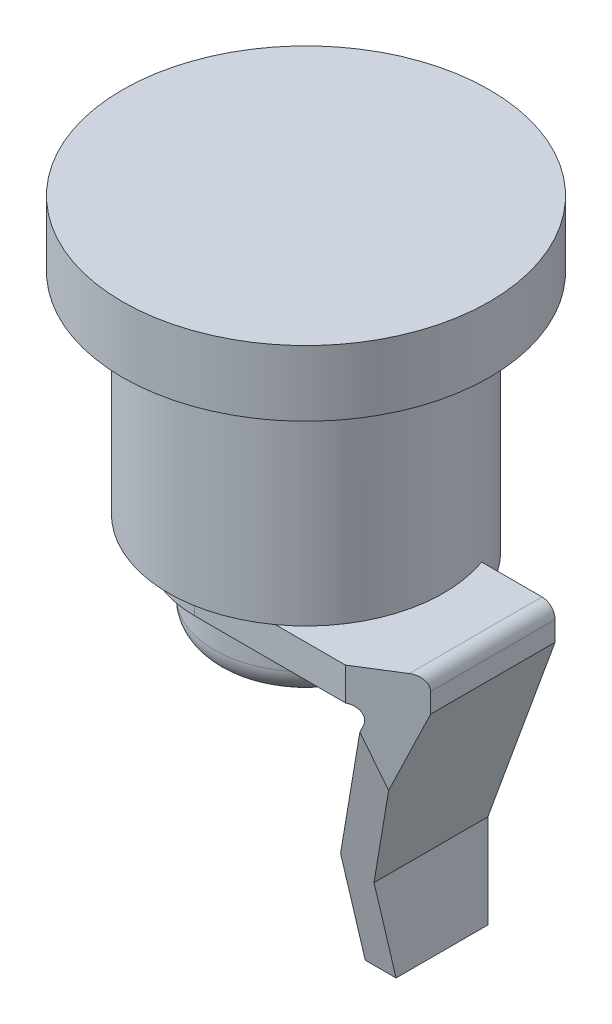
ISO-10303-21;
HEADER;
FILE_DESCRIPTION(('STEP AP214'),'2;1');
FILE_NAME('part.step','',(''),(''),'','','');
FILE_SCHEMA(('AUTOMOTIVE_DESIGN { 1 0 10303 214 1 1 1 1 }'));
ENDSEC;
DATA;
#1=APPLICATION_CONTEXT('core data for automotive mechanical design processes');
#2=APPLICATION_PROTOCOL_DEFINITION('international standard','automotive_design',2000,#1);
#3=PRODUCT_CONTEXT('',#1,'mechanical');
#4=PRODUCT('Part','Part','',(#3));
#5=PRODUCT_RELATED_PRODUCT_CATEGORY('part','',(#4));
#6=PRODUCT_DEFINITION_FORMATION('','',#4);
#7=PRODUCT_DEFINITION_CONTEXT('part definition',#1,'design');
#8=PRODUCT_DEFINITION('design','',#6,#7);
#9=PRODUCT_DEFINITION_SHAPE('','',#8);
#10=(LENGTH_UNIT() NAMED_UNIT(*) SI_UNIT(.MILLI.,.METRE.));
#11=(NAMED_UNIT(*) PLANE_ANGLE_UNIT() SI_UNIT($,.RADIAN.));
#12=(NAMED_UNIT(*) SI_UNIT($,.STERADIAN.) SOLID_ANGLE_UNIT());
#13=UNCERTAINTY_MEASURE_WITH_UNIT(LENGTH_MEASURE(1.E-05),#10,'distance_accuracy_value','');
#14=(GEOMETRIC_REPRESENTATION_CONTEXT(3) GLOBAL_UNCERTAINTY_ASSIGNED_CONTEXT((#13)) GLOBAL_UNIT_ASSIGNED_CONTEXT((#10,
#11,#12)) REPRESENTATION_CONTEXT('',''));
#15=CARTESIAN_POINT('',(0.,0.,0.));
#16=DIRECTION('',(0.,0.,1.));
#17=DIRECTION('',(1.,0.,0.));
#18=AXIS2_PLACEMENT_3D('',#15,#16,#17);
#19=CARTESIAN_POINT('',(8.02046629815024,-31.7403389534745,-31.018779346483));
#20=DIRECTION('',(-0.93969262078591,0.342020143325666,0.));
#21=DIRECTION('',(-0.342020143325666,-0.93969262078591,0.));
#22=AXIS2_PLACEMENT_3D('',#19,#20,#21);
#23=PLANE('',#22);
#24=DIRECTION('',(0.342020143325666,0.93969262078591,0.));
#25=VECTOR('',#24,1.);
#26=CARTESIAN_POINT('',(8.02046629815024,-31.7403389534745,-3.5));
#27=LINE('',#26,#25);
#28=CARTESIAN_POINT('',(8.02046629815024,-31.7403389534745,-3.5));
#29=VERTEX_POINT('',#28);
#30=CARTESIAN_POINT('',(12.351100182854,-19.8420201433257,-3.5));
#31=VERTEX_POINT('',#30);
#32=EDGE_CURVE('E310',#29,#31,#27,.T.);
#33=ORIENTED_EDGE('',*,*,#32,.F.);
#34=DIRECTION('',(0.,0.,1.));
#35=VECTOR('',#34,1.);
#36=CARTESIAN_POINT('',(8.02046629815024,-31.7403389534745,-31.018779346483));
#37=LINE('',#36,#35);
#38=CARTESIAN_POINT('',(8.02046629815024,-31.7403389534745,5.38320911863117));
#39=VERTEX_POINT('',#38);
#40=EDGE_CURVE('E177',#29,#39,#37,.T.);
#41=ORIENTED_EDGE('',*,*,#40,.T.);
#42=DIRECTION('',(0.333947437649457,0.917513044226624,0.215983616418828));
#43=VECTOR('',#42,1.);
#44=CARTESIAN_POINT('',(5.39489369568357,-38.9540403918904,3.6850955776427));
#45=LINE('',#44,#43);
#46=CARTESIAN_POINT('',(12.1812374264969,-20.3087142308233,8.07422660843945));
#47=VERTEX_POINT('',#46);
#48=EDGE_CURVE('E267',#39,#47,#45,.T.);
#49=ORIENTED_EDGE('',*,*,#48,.T.);
#50=DIRECTION('',(-0.334463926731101,-0.918932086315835,0.209039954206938));
#51=VECTOR('',#50,1.);
#52=CARTESIAN_POINT('',(10.9355217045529,-23.7312900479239,8.85279893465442));
#53=LINE('',#52,#51);
#54=CARTESIAN_POINT('',(12.351100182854,-19.8420201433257,7.96806238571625));
#55=VERTEX_POINT('',#54);
#56=EDGE_CURVE('E50',#55,#47,#53,.T.);
#57=ORIENTED_EDGE('',*,*,#56,.F.);
#58=DIRECTION('',(0.,0.,1.));
#59=VECTOR('',#58,1.);
#60=CARTESIAN_POINT('',(12.351100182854,-19.8420201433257,-8.5));
#61=LINE('',#60,#59);
#62=EDGE_CURVE('E230',#55,#31,#61,.F.);
#63=ORIENTED_EDGE('',*,*,#62,.T.);
#64=EDGE_LOOP('',(#33,#41,#49,#57,#63));
#65=FACE_BOUND('',#64,.T.);
#66=ADVANCED_FACE('F35',(#65),#23,.T.);
#67=CARTESIAN_POINT('',(0.,-18.5,0.));
#68=DIRECTION('',(0.,-1.,0.));
#69=DIRECTION('',(0.,0.,-1.));
#70=AXIS2_PLACEMENT_3D('',#67,#68,#69);
#71=PLANE('',#70);
#72=CARTESIAN_POINT('',(0.,-18.5,0.));
#73=DIRECTION('',(0.,-1.,0.));
#74=DIRECTION('',(0.,0.,-1.));
#75=AXIS2_PLACEMENT_3D('',#72,#73,#74);
#76=CIRCLE('',#75,7.);
#77=CARTESIAN_POINT('',(0.,-18.5,-7.));
#78=VERTEX_POINT('',#77);
#79=EDGE_CURVE('E203',#78,#78,#76,.T.);
#80=ORIENTED_EDGE('',*,*,#79,.F.);
#81=EDGE_LOOP('',(#80));
#82=FACE_BOUND('',#81,.T.);
#83=DIRECTION('',(-1.,0.,0.));
#84=VECTOR('',#83,1.);
#85=CARTESIAN_POINT('',(0.,-18.5,-3.5));
#86=LINE('',#85,#84);
#87=CARTESIAN_POINT('',(11.4114075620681,-18.5,-3.5));
#88=VERTEX_POINT('',#87);
#89=CARTESIAN_POINT('',(9.89949493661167,-18.5,-3.5));
#90=VERTEX_POINT('',#89);
#91=EDGE_CURVE('E306',#88,#90,#86,.T.);
#92=ORIENTED_EDGE('',*,*,#91,.F.);
#93=DIRECTION('',(0.,0.,1.));
#94=VECTOR('',#93,1.);
#95=CARTESIAN_POINT('',(11.4114075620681,-18.5,8.5));
#96=LINE('',#95,#94);
#97=CARTESIAN_POINT('',(11.4114075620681,-18.5,8.5));
#98=VERTEX_POINT('',#97);
#99=EDGE_CURVE('E58',#88,#98,#96,.T.);
#100=ORIENTED_EDGE('',*,*,#99,.T.);
#101=DIRECTION('',(1.,0.,0.));
#102=VECTOR('',#101,1.);
#103=CARTESIAN_POINT('',(0.,-18.5,8.5));
#104=LINE('',#103,#102);
#105=CARTESIAN_POINT('',(0.,-18.5,8.5));
#106=VERTEX_POINT('',#105);
#107=EDGE_CURVE('E192',#106,#98,#104,.T.);
#108=ORIENTED_EDGE('',*,*,#107,.F.);
#109=CARTESIAN_POINT('',(0.,-18.5,0.));
#110=DIRECTION('',(0.,-1.,0.));
#111=DIRECTION('',(0.,0.,-1.));
#112=AXIS2_PLACEMENT_3D('',#109,#110,#111);
#113=CIRCLE('',#112,8.5);
#114=CARTESIAN_POINT('',(0.,-18.5,-8.5));
#115=VERTEX_POINT('',#114);
#116=EDGE_CURVE('E200',#106,#115,#113,.T.);
#117=ORIENTED_EDGE('',*,*,#116,.T.);
#118=DIRECTION('',(1.,0.,0.));
#119=VECTOR('',#118,1.);
#120=CARTESIAN_POINT('',(0.,-18.5,-8.5));
#121=LINE('',#120,#119);
#122=CARTESIAN_POINT('',(6.16441400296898,-18.5,-8.5));
#123=VERTEX_POINT('',#122);
#124=EDGE_CURVE('E194',#115,#123,#121,.T.);
#125=ORIENTED_EDGE('',*,*,#124,.T.);
#126=CARTESIAN_POINT('',(0.,-18.5,0.));
#127=DIRECTION('',(0.,-1.,0.));
#128=DIRECTION('',(0.,0.,-1.));
#129=AXIS2_PLACEMENT_3D('',#126,#127,#128);
#130=CIRCLE('',#129,10.5);
#131=EDGE_CURVE('E304',#90,#123,#130,.F.);
#132=ORIENTED_EDGE('',*,*,#131,.F.);
#133=EDGE_LOOP('',(#92,#100,#108,#117,#125,#132));
#134=FACE_BOUND('',#133,.T.);
#135=ADVANCED_FACE('F314',(#82,#134),#71,.T.);
#136=CARTESIAN_POINT('',(-13.800441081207,-2.86718192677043,12.179983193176));
#137=DIRECTION('',(0.,-0.229138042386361,0.973393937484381));
#138=DIRECTION('',(0.,-0.973393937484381,-0.229138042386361));
#139=AXIS2_PLACEMENT_3D('',#136,#137,#138);
#140=PLANE('',#139);
#141=DIRECTION('',(0.344216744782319,-0.913910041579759,-0.215135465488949));
#142=VECTOR('',#141,1.);
#143=CARTESIAN_POINT('',(3.31193737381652,3.2396531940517,13.6175391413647));
#144=LINE('',#143,#142);
#145=CARTESIAN_POINT('',(11.5,-18.5,8.5));
#146=VERTEX_POINT('',#145);
#147=CARTESIAN_POINT('',(11.501532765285,-18.5040695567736,8.4990420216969));
#148=VERTEX_POINT('',#147);
#149=EDGE_CURVE('E43',#146,#148,#144,.T.);
#150=ORIENTED_EDGE('',*,*,#149,.F.);
#151=DIRECTION('',(1.,0.,0.));
#152=VECTOR('',#151,1.);
#153=CARTESIAN_POINT('',(-13.800441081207,-18.5,8.5));
#154=LINE('',#153,#152);
#155=EDGE_CURVE('E167',#98,#146,#154,.T.);
#156=ORIENTED_EDGE('',*,*,#155,.F.);
#157=CARTESIAN_POINT('',(11.4114075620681,-19.5,8.26459886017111));
#158=DIRECTION('',(0.,-0.229138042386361,0.973393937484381));
#159=DIRECTION('',(0.,-0.973393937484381,-0.229138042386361));
#160=AXIS2_PLACEMENT_3D('',#157,#158,#159);
#161=ELLIPSE('',#160,1.02733329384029,1.);
#162=EDGE_CURVE('E239',#98,#148,#161,.F.);
#163=ORIENTED_EDGE('',*,*,#162,.T.);
#164=EDGE_LOOP('',(#150,#156,#163));
#165=FACE_BOUND('',#164,.T.);
#166=ADVANCED_FACE('F259',(#165),#140,.T.);
#167=CARTESIAN_POINT('',(0.,-16.,8.5));
#168=DIRECTION('',(0.,0.,-1.));
#169=DIRECTION('',(-1.,0.,0.));
#170=AXIS2_PLACEMENT_3D('',#167,#168,#169);
#171=PLANE('',#170);
#172=ORIENTED_EDGE('',*,*,#155,.T.);
#173=DIRECTION('',(0.,1.,0.));
#174=VECTOR('',#173,1.);
#175=CARTESIAN_POINT('',(11.5,-36.,8.5));
#176=LINE('',#175,#174);
#177=CARTESIAN_POINT('',(11.5,-16.,8.5));
#178=VERTEX_POINT('',#177);
#179=EDGE_CURVE('E248',#146,#178,#176,.T.);
#180=ORIENTED_EDGE('',*,*,#179,.T.);
#181=DIRECTION('',(1.,0.,0.));
#182=VECTOR('',#181,1.);
#183=CARTESIAN_POINT('',(0.,-16.,8.5));
#184=LINE('',#183,#182);
#185=CARTESIAN_POINT('',(6.16441400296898,-16.,8.5));
#186=VERTEX_POINT('',#185);
#187=EDGE_CURVE('E186',#186,#178,#184,.T.);
#188=ORIENTED_EDGE('',*,*,#187,.F.);
#189=CARTESIAN_POINT('',(0.,-16.,8.5));
#190=VERTEX_POINT('',#189);
#191=EDGE_CURVE('E182',#190,#186,#184,.T.);
#192=ORIENTED_EDGE('',*,*,#191,.F.);
#193=DIRECTION('',(0.,-1.,0.));
#194=VECTOR('',#193,1.);
#195=CARTESIAN_POINT('',(0.,-16.,8.5));
#196=LINE('',#195,#194);
#197=EDGE_CURVE('E189',#190,#106,#196,.T.);
#198=ORIENTED_EDGE('',*,*,#197,.T.);
#199=ORIENTED_EDGE('',*,*,#107,.T.);
#200=EDGE_LOOP('',(#172,#180,#188,#192,#198,#199));
#201=FACE_BOUND('',#200,.T.);
#202=ADVANCED_FACE('F336',(#201),#171,.F.);
#203=CARTESIAN_POINT('',(8.02046629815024,-31.7403389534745,-31.018779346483));
#204=DIRECTION('',(-1.,0.,0.));
#205=DIRECTION('',(0.,-1.,0.));
#206=AXIS2_PLACEMENT_3D('',#203,#204,#205);
#207=PLANE('',#206);
#208=DIRECTION('',(0.,1.,0.));
#209=VECTOR('',#208,1.);
#210=CARTESIAN_POINT('',(8.02046629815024,-31.7403389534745,-3.5));
#211=LINE('',#210,#209);
#212=CARTESIAN_POINT('',(8.02046629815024,-39.7403389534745,-3.5));
#213=VERTEX_POINT('',#212);
#214=EDGE_CURVE('E284',#213,#29,#211,.T.);
#215=ORIENTED_EDGE('',*,*,#214,.F.);
#216=DIRECTION('',(0.,0.,1.));
#217=VECTOR('',#216,1.);
#218=CARTESIAN_POINT('',(8.02046629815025,-39.7403389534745,-31.018779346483));
#219=LINE('',#218,#217);
#220=CARTESIAN_POINT('',(8.02046629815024,-39.7403389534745,3.5));
#221=VERTEX_POINT('',#220);
#222=EDGE_CURVE('E166',#213,#221,#219,.T.);
#223=ORIENTED_EDGE('',*,*,#222,.T.);
#224=DIRECTION('',(0.,-0.973393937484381,-0.229138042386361));
#225=VECTOR('',#224,1.);
#226=CARTESIAN_POINT('',(8.02046629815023,-2.86718192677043,12.179983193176));
#227=LINE('',#226,#225);
#228=EDGE_CURVE('E263',#39,#221,#227,.T.);
#229=ORIENTED_EDGE('',*,*,#228,.F.);
#230=ORIENTED_EDGE('',*,*,#40,.F.);
#231=EDGE_LOOP('',(#215,#223,#229,#230));
#232=FACE_BOUND('',#231,.T.);
#233=ADVANCED_FACE('F282',(#232),#207,.T.);
#234=CARTESIAN_POINT('',(8.02046629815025,-39.7403389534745,-31.018779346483));
#235=DIRECTION('',(0.,-1.,0.));
#236=DIRECTION('',(0.,0.,-1.));
#237=AXIS2_PLACEMENT_3D('',#234,#235,#236);
#238=PLANE('',#237);
#239=DIRECTION('',(0.,0.,1.));
#240=VECTOR('',#239,1.);
#241=CARTESIAN_POINT('',(10.369697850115,-39.7403389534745,-31.018779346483));
#242=LINE('',#241,#240);
#243=CARTESIAN_POINT('',(10.369697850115,-39.7403389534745,-3.5));
#244=VERTEX_POINT('',#243);
#245=CARTESIAN_POINT('',(10.369697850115,-39.7403389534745,3.5));
#246=VERTEX_POINT('',#245);
#247=EDGE_CURVE('E164',#244,#246,#242,.T.);
#248=ORIENTED_EDGE('',*,*,#247,.T.);
#249=DIRECTION('',(1.,0.,0.));
#250=VECTOR('',#249,1.);
#251=CARTESIAN_POINT('',(-13.800441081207,-39.7403389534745,3.5));
#252=LINE('',#251,#250);
#253=EDGE_CURVE('E261',#221,#246,#252,.T.);
#254=ORIENTED_EDGE('',*,*,#253,.F.);
#255=ORIENTED_EDGE('',*,*,#222,.F.);
#256=DIRECTION('',(1.,0.,0.));
#257=VECTOR('',#256,1.);
#258=CARTESIAN_POINT('',(-13.800441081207,-39.7403389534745,-3.5));
#259=LINE('',#258,#257);
#260=EDGE_CURVE('E151',#213,#244,#259,.T.);
#261=ORIENTED_EDGE('',*,*,#260,.T.);
#262=EDGE_LOOP('',(#248,#254,#255,#261));
#263=FACE_BOUND('',#262,.T.);
#264=ADVANCED_FACE('F162',(#263),#238,.T.);
#265=CARTESIAN_POINT('',(10.369697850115,-39.7403389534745,-31.018779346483));
#266=DIRECTION('',(1.,0.,0.));
#267=DIRECTION('',(0.,0.,-1.));
#268=AXIS2_PLACEMENT_3D('',#265,#266,#267);
#269=PLANE('',#268);
#270=ORIENTED_EDGE('',*,*,#247,.F.);
#271=DIRECTION('',(0.,-1.,0.));
#272=VECTOR('',#271,1.);
#273=CARTESIAN_POINT('',(10.369697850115,-39.7403389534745,-3.5));
#274=LINE('',#273,#272);
#275=CARTESIAN_POINT('',(10.369697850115,-32.5953893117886,-3.5));
#276=VERTEX_POINT('',#275);
#277=EDGE_CURVE('E147',#276,#244,#274,.T.);
#278=ORIENTED_EDGE('',*,*,#277,.F.);
#279=DIRECTION('',(0.,0.,1.));
#280=VECTOR('',#279,1.);
#281=CARTESIAN_POINT('',(10.369697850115,-32.5953893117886,-31.018779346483));
#282=LINE('',#281,#280);
#283=CARTESIAN_POINT('',(10.369697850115,-32.5953893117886,5.1819292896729));
#284=VERTEX_POINT('',#283);
#285=EDGE_CURVE('E173',#276,#284,#282,.T.);
#286=ORIENTED_EDGE('',*,*,#285,.T.);
#287=DIRECTION('',(0.,-0.973393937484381,-0.229138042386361));
#288=VECTOR('',#287,1.);
#289=CARTESIAN_POINT('',(10.369697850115,-47.4394620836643,1.68761763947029));
#290=LINE('',#289,#288);
#291=EDGE_CURVE('E172',#284,#246,#290,.T.);
#292=ORIENTED_EDGE('',*,*,#291,.T.);
#293=EDGE_LOOP('',(#270,#278,#286,#292));
#294=FACE_BOUND('',#293,.T.);
#295=ADVANCED_FACE('F170',(#294),#269,.T.);
#296=CARTESIAN_POINT('',(15.5,-18.5,-31.018779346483));
#297=DIRECTION('',(0.93969262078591,-0.342020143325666,0.));
#298=DIRECTION('',(0.342020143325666,0.93969262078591,0.));
#299=AXIS2_PLACEMENT_3D('',#296,#297,#298);
#300=PLANE('',#299);
#301=DIRECTION('',(0.334463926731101,0.918932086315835,-0.209039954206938));
#302=VECTOR('',#301,1.);
#303=CARTESIAN_POINT('',(18.0882169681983,-11.3889323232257,4.38236439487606));
#304=LINE('',#303,#302);
#305=CARTESIAN_POINT('',(13.5342192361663,-23.9009382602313,7.22861297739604));
#306=VERTEX_POINT('',#305);
#307=CARTESIAN_POINT('',(15.5,-18.5,6.));
#308=VERTEX_POINT('',#307);
#309=EDGE_CURVE('E276',#306,#308,#304,.T.);
#310=ORIENTED_EDGE('',*,*,#309,.F.);
#311=DIRECTION('',(-0.333947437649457,-0.917513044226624,-0.215983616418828));
#312=VECTOR('',#311,1.);
#313=CARTESIAN_POINT('',(12.6496220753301,-26.3313489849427,6.65649152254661));
#314=LINE('',#313,#312);
#315=EDGE_CURVE('E270',#306,#284,#314,.T.);
#316=ORIENTED_EDGE('',*,*,#315,.T.);
#317=ORIENTED_EDGE('',*,*,#285,.F.);
#318=DIRECTION('',(-0.342020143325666,-0.93969262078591,0.));
#319=VECTOR('',#318,1.);
#320=CARTESIAN_POINT('',(15.5,-18.5,-3.5));
#321=LINE('',#320,#319);
#322=CARTESIAN_POINT('',(15.5,-18.5,-3.5));
#323=VERTEX_POINT('',#322);
#324=EDGE_CURVE('E154',#323,#276,#321,.T.);
#325=ORIENTED_EDGE('',*,*,#324,.F.);
#326=DIRECTION('',(0.,0.,-1.));
#327=VECTOR('',#326,1.);
#328=CARTESIAN_POINT('',(15.5,-18.5,0.));
#329=LINE('',#328,#327);
#330=EDGE_CURVE('E175',#308,#323,#329,.T.);
#331=ORIENTED_EDGE('',*,*,#330,.F.);
#332=EDGE_LOOP('',(#310,#316,#317,#325,#331));
#333=FACE_BOUND('',#332,.T.);
#334=ADVANCED_FACE('F274',(#333),#300,.T.);
#335=CARTESIAN_POINT('',(11.4114075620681,-19.5,0.));
#336=DIRECTION('',(0.,0.,-1.));
#337=DIRECTION('',(-1.,0.,0.));
#338=AXIS2_PLACEMENT_3D('',#335,#336,#337);
#339=CYLINDRICAL_SURFACE('',#338,1.);
#340=ORIENTED_EDGE('',*,*,#62,.F.);
#341=CARTESIAN_POINT('',(11.4114075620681,-19.5,8.55537027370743));
#342=DIRECTION('',(-0.52999894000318,0.,-0.847998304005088));
#343=DIRECTION('',(0.847998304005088,0.,-0.52999894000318));
#344=AXIS2_PLACEMENT_3D('',#341,#342,#343);
#345=ELLIPSE('',#344,1.17924764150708,1.);
#346=EDGE_CURVE('E246',#55,#148,#345,.F.);
#347=ORIENTED_EDGE('',*,*,#346,.T.);
#348=ORIENTED_EDGE('',*,*,#162,.F.);
#349=ORIENTED_EDGE('',*,*,#99,.F.);
#350=CARTESIAN_POINT('',(11.4114075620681,-19.5,-3.5));
#351=DIRECTION('',(0.,0.,1.));
#352=DIRECTION('',(1.,0.,0.));
#353=AXIS2_PLACEMENT_3D('',#350,#351,#352);
#354=CIRCLE('',#353,1.);
#355=EDGE_CURVE('E308',#88,#31,#354,.F.);
#356=ORIENTED_EDGE('',*,*,#355,.T.);
#357=EDGE_LOOP('',(#340,#347,#348,#349,#356));
#358=FACE_BOUND('',#357,.T.);
#359=ADVANCED_FACE('F255',(#358),#339,.F.);
#360=CARTESIAN_POINT('',(0.,-18.5,0.));
#361=DIRECTION('',(0.,1.,0.));
#362=DIRECTION('',(0.,0.,1.));
#363=AXIS2_PLACEMENT_3D('',#360,#361,#362);
#364=CYLINDRICAL_SURFACE('',#363,8.5);
#365=DIRECTION('',(0.,-1.,0.));
#366=VECTOR('',#365,1.);
#367=CARTESIAN_POINT('',(0.,-16.,-8.5));
#368=LINE('',#367,#366);
#369=CARTESIAN_POINT('',(0.,-16.,-8.5));
#370=VERTEX_POINT('',#369);
#371=EDGE_CURVE('E197',#370,#115,#368,.T.);
#372=ORIENTED_EDGE('',*,*,#371,.T.);
#373=ORIENTED_EDGE('',*,*,#116,.F.);
#374=ORIENTED_EDGE('',*,*,#197,.F.);
#375=CARTESIAN_POINT('',(0.,-16.,0.));
#376=DIRECTION('',(0.,-1.,0.));
#377=DIRECTION('',(0.,0.,-1.));
#378=AXIS2_PLACEMENT_3D('',#375,#376,#377);
#379=CIRCLE('',#378,8.5);
#380=EDGE_CURVE('E207',#190,#370,#379,.T.);
#381=ORIENTED_EDGE('',*,*,#380,.T.);
#382=EDGE_LOOP('',(#372,#373,#374,#381));
#383=FACE_BOUND('',#382,.T.);
#384=ADVANCED_FACE('F351',(#383),#364,.T.);
#385=CARTESIAN_POINT('',(0.,5.,0.));
#386=DIRECTION('',(0.,-1.,0.));
#387=DIRECTION('',(0.,0.,-1.));
#388=AXIS2_PLACEMENT_3D('',#385,#386,#387);
#389=CYLINDRICAL_SURFACE('',#388,14.);
#390=CARTESIAN_POINT('',(0.,5.,0.));
#391=DIRECTION('',(0.,1.,0.));
#392=DIRECTION('',(0.,0.,1.));
#393=AXIS2_PLACEMENT_3D('',#390,#391,#392);
#394=CIRCLE('',#393,14.);
#395=CARTESIAN_POINT('',(0.,5.,14.));
#396=VERTEX_POINT('',#395);
#397=EDGE_CURVE('E219',#396,#396,#394,.T.);
#398=ORIENTED_EDGE('',*,*,#397,.F.);
#399=EDGE_LOOP('',(#398));
#400=FACE_BOUND('',#399,.T.);
#401=CARTESIAN_POINT('',(0.,0.,0.));
#402=DIRECTION('',(0.,1.,0.));
#403=DIRECTION('',(0.,0.,1.));
#404=AXIS2_PLACEMENT_3D('',#401,#402,#403);
#405=CIRCLE('',#404,14.);
#406=CARTESIAN_POINT('',(0.,0.,14.));
#407=VERTEX_POINT('',#406);
#408=EDGE_CURVE('E216',#407,#407,#405,.T.);
#409=ORIENTED_EDGE('',*,*,#408,.T.);
#410=EDGE_LOOP('',(#409));
#411=FACE_BOUND('',#410,.T.);
#412=ADVANCED_FACE('F354',(#400,#411),#389,.T.);
#413=CARTESIAN_POINT('',(0.,5.,0.));
#414=DIRECTION('',(0.,1.,0.));
#415=DIRECTION('',(0.,0.,1.));
#416=AXIS2_PLACEMENT_3D('',#413,#414,#415);
#417=PLANE('',#416);
#418=ORIENTED_EDGE('',*,*,#397,.T.);
#419=EDGE_LOOP('',(#418));
#420=FACE_BOUND('',#419,.T.);
#421=ADVANCED_FACE('F364',(#420),#417,.T.);
#422=CARTESIAN_POINT('',(0.,0.,0.));
#423=DIRECTION('',(0.,1.,0.));
#424=DIRECTION('',(0.,0.,1.));
#425=AXIS2_PLACEMENT_3D('',#422,#423,#424);
#426=PLANE('',#425);
#427=CARTESIAN_POINT('',(0.,0.,0.));
#428=DIRECTION('',(0.,-1.,0.));
#429=DIRECTION('',(0.,0.,-1.));
#430=AXIS2_PLACEMENT_3D('',#427,#428,#429);
#431=CIRCLE('',#430,10.5);
#432=CARTESIAN_POINT('',(0.,0.,-10.5));
#433=VERTEX_POINT('',#432);
#434=EDGE_CURVE('E213',#433,#433,#431,.T.);
#435=ORIENTED_EDGE('',*,*,#434,.F.);
#436=EDGE_LOOP('',(#435));
#437=FACE_BOUND('',#436,.T.);
#438=ORIENTED_EDGE('',*,*,#408,.F.);
#439=EDGE_LOOP('',(#438));
#440=FACE_BOUND('',#439,.T.);
#441=ADVANCED_FACE('F362',(#437,#440),#426,.F.);
#442=CARTESIAN_POINT('',(0.,-16.,0.));
#443=DIRECTION('',(0.,1.,0.));
#444=DIRECTION('',(0.,0.,1.));
#445=AXIS2_PLACEMENT_3D('',#442,#443,#444);
#446=CYLINDRICAL_SURFACE('',#445,10.5);
#447=CARTESIAN_POINT('',(0.,-16.,0.));
#448=DIRECTION('',(0.,-1.,0.));
#449=DIRECTION('',(0.,0.,-1.));
#450=AXIS2_PLACEMENT_3D('',#447,#448,#449);
#451=CIRCLE('',#450,10.5);
#452=CARTESIAN_POINT('',(9.89949493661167,-16.,-3.5));
#453=VERTEX_POINT('',#452);
#454=EDGE_CURVE('E214',#453,#186,#451,.T.);
#455=ORIENTED_EDGE('',*,*,#454,.F.);
#456=DIRECTION('',(0.,1.,0.));
#457=VECTOR('',#456,1.);
#458=CARTESIAN_POINT('',(9.89949493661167,-36.,-3.5));
#459=LINE('',#458,#457);
#460=EDGE_CURVE('E298',#90,#453,#459,.T.);
#461=ORIENTED_EDGE('',*,*,#460,.F.);
#462=ORIENTED_EDGE('',*,*,#131,.T.);
#463=DIRECTION('',(0.,1.,0.));
#464=VECTOR('',#463,1.);
#465=CARTESIAN_POINT('',(6.16441400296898,-36.,-8.5));
#466=LINE('',#465,#464);
#467=CARTESIAN_POINT('',(6.16441400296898,-16.,-8.5));
#468=VERTEX_POINT('',#467);
#469=EDGE_CURVE('E287',#123,#468,#466,.T.);
#470=ORIENTED_EDGE('',*,*,#469,.T.);
#471=EDGE_CURVE('E210',#186,#468,#451,.T.);
#472=ORIENTED_EDGE('',*,*,#471,.F.);
#473=EDGE_LOOP('',(#455,#461,#462,#470,#472));
#474=FACE_BOUND('',#473,.T.);
#475=ORIENTED_EDGE('',*,*,#434,.T.);
#476=EDGE_LOOP('',(#475));
#477=FACE_BOUND('',#476,.T.);
#478=ADVANCED_FACE('F358',(#474,#477),#446,.T.);
#479=CARTESIAN_POINT('',(0.,-16.,0.));
#480=DIRECTION('',(0.,-1.,0.));
#481=DIRECTION('',(0.,0.,-1.));
#482=AXIS2_PLACEMENT_3D('',#479,#480,#481);
#483=PLANE('',#482);
#484=DIRECTION('',(1.,0.,0.));
#485=VECTOR('',#484,1.);
#486=CARTESIAN_POINT('',(0.,-16.,-8.5));
#487=LINE('',#486,#485);
#488=EDGE_CURVE('E185',#370,#468,#487,.T.);
#489=ORIENTED_EDGE('',*,*,#488,.F.);
#490=ORIENTED_EDGE('',*,*,#380,.F.);
#491=ORIENTED_EDGE('',*,*,#191,.T.);
#492=ORIENTED_EDGE('',*,*,#471,.T.);
#493=EDGE_LOOP('',(#489,#490,#491,#492));
#494=FACE_BOUND('',#493,.T.);
#495=ADVANCED_FACE('F348',(#494),#483,.T.);
#496=CARTESIAN_POINT('',(0.,-23.5,0.));
#497=DIRECTION('',(0.,1.,0.));
#498=DIRECTION('',(0.,0.,1.));
#499=AXIS2_PLACEMENT_3D('',#496,#497,#498);
#500=CYLINDRICAL_SURFACE('',#499,7.);
#501=CARTESIAN_POINT('',(0.,-21.5,0.));
#502=DIRECTION('',(0.,-1.,0.));
#503=DIRECTION('',(0.,0.,-1.));
#504=AXIS2_PLACEMENT_3D('',#501,#502,#503);
#505=CIRCLE('',#504,7.);
#506=CARTESIAN_POINT('',(0.,-21.5,-7.));
#507=VERTEX_POINT('',#506);
#508=EDGE_CURVE('E226',#507,#507,#505,.F.);
#509=ORIENTED_EDGE('',*,*,#508,.T.);
#510=EDGE_LOOP('',(#509));
#511=FACE_BOUND('',#510,.T.);
#512=ORIENTED_EDGE('',*,*,#79,.T.);
#513=EDGE_LOOP('',(#512));
#514=FACE_BOUND('',#513,.T.);
#515=ADVANCED_FACE('F345',(#511,#514),#500,.T.);
#516=CARTESIAN_POINT('',(0.,-23.5,0.));
#517=DIRECTION('',(0.,-1.,0.));
#518=DIRECTION('',(0.,0.,-1.));
#519=AXIS2_PLACEMENT_3D('',#516,#517,#518);
#520=PLANE('',#519);
#521=CARTESIAN_POINT('',(0.,-23.5,0.));
#522=DIRECTION('',(0.,-1.,0.));
#523=DIRECTION('',(0.,0.,-1.));
#524=AXIS2_PLACEMENT_3D('',#521,#522,#523);
#525=CIRCLE('',#524,5.);
#526=CARTESIAN_POINT('',(0.,-23.5,-5.));
#527=VERTEX_POINT('',#526);
#528=EDGE_CURVE('E206',#527,#527,#525,.T.);
#529=ORIENTED_EDGE('',*,*,#528,.T.);
#530=EDGE_LOOP('',(#529));
#531=FACE_BOUND('',#530,.T.);
#532=ADVANCED_FACE('F342',(#531),#520,.T.);
#533=CARTESIAN_POINT('',(0.,-21.5,0.));
#534=DIRECTION('',(0.,-1.,0.));
#535=DIRECTION('',(0.,0.,-1.));
#536=AXIS2_PLACEMENT_3D('',#533,#534,#535);
#537=TOROIDAL_SURFACE('',#536,5.,2.);
#538=ORIENTED_EDGE('',*,*,#508,.F.);
#539=EDGE_LOOP('',(#538));
#540=FACE_BOUND('',#539,.T.);
#541=ORIENTED_EDGE('',*,*,#528,.F.);
#542=EDGE_LOOP('',(#541));
#543=FACE_BOUND('',#542,.T.);
#544=ADVANCED_FACE('F330',(#540,#543),#537,.T.);
#545=CARTESIAN_POINT('',(0.,-16.,0.));
#546=DIRECTION('',(0.,-1.,0.));
#547=DIRECTION('',(0.,0.,-1.));
#548=AXIS2_PLACEMENT_3D('',#545,#546,#547);
#549=PLANE('',#548);
#550=ORIENTED_EDGE('',*,*,#187,.T.);
#551=DIRECTION('',(-0.847998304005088,0.,0.52999894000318));
#552=VECTOR('',#551,1.);
#553=CARTESIAN_POINT('',(7.05056179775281,-16.,11.2808988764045));
#554=LINE('',#553,#552);
#555=CARTESIAN_POINT('',(14.5,-16.,6.625));
#556=VERTEX_POINT('',#555);
#557=EDGE_CURVE('E290',#556,#178,#554,.T.);
#558=ORIENTED_EDGE('',*,*,#557,.F.);
#559=DIRECTION('',(0.,0.,-1.));
#560=VECTOR('',#559,1.);
#561=CARTESIAN_POINT('',(14.5,-16.,0.));
#562=LINE('',#561,#560);
#563=CARTESIAN_POINT('',(14.5,-16.,-3.5));
#564=VERTEX_POINT('',#563);
#565=EDGE_CURVE('E233',#556,#564,#562,.T.);
#566=ORIENTED_EDGE('',*,*,#565,.T.);
#567=DIRECTION('',(1.,0.,0.));
#568=VECTOR('',#567,1.);
#569=CARTESIAN_POINT('',(0.,-16.,-3.5));
#570=LINE('',#569,#568);
#571=EDGE_CURVE('E285',#453,#564,#570,.T.);
#572=ORIENTED_EDGE('',*,*,#571,.F.);
#573=ORIENTED_EDGE('',*,*,#454,.T.);
#574=EDGE_LOOP('',(#550,#558,#566,#572,#573));
#575=FACE_BOUND('',#574,.T.);
#576=ADVANCED_FACE('F326',(#575),#549,.F.);
#577=CARTESIAN_POINT('',(15.5,-16.,0.));
#578=DIRECTION('',(-1.,0.,0.));
#579=DIRECTION('',(0.,0.,1.));
#580=AXIS2_PLACEMENT_3D('',#577,#578,#579);
#581=PLANE('',#580);
#582=DIRECTION('',(0.,0.,-1.));
#583=VECTOR('',#582,1.);
#584=CARTESIAN_POINT('',(15.5,-17.,0.));
#585=LINE('',#584,#583);
#586=CARTESIAN_POINT('',(15.5,-17.,-3.5));
#587=VERTEX_POINT('',#586);
#588=CARTESIAN_POINT('',(15.5,-17.,6.00000000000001));
#589=VERTEX_POINT('',#588);
#590=EDGE_CURVE('E236',#587,#589,#585,.F.);
#591=ORIENTED_EDGE('',*,*,#590,.T.);
#592=DIRECTION('',(0.,1.,0.));
#593=VECTOR('',#592,1.);
#594=CARTESIAN_POINT('',(15.5,-36.,6.));
#595=LINE('',#594,#593);
#596=EDGE_CURVE('E292',#308,#589,#595,.T.);
#597=ORIENTED_EDGE('',*,*,#596,.F.);
#598=ORIENTED_EDGE('',*,*,#330,.T.);
#599=DIRECTION('',(0.,1.,0.));
#600=VECTOR('',#599,1.);
#601=CARTESIAN_POINT('',(15.5,-36.,-3.5));
#602=LINE('',#601,#600);
#603=EDGE_CURVE('E293',#323,#587,#602,.T.);
#604=ORIENTED_EDGE('',*,*,#603,.T.);
#605=EDGE_LOOP('',(#591,#597,#598,#604));
#606=FACE_BOUND('',#605,.T.);
#607=ADVANCED_FACE('F329',(#606),#581,.F.);
#608=CARTESIAN_POINT('',(0.,-16.,-8.5));
#609=DIRECTION('',(0.,0.,-1.));
#610=DIRECTION('',(-1.,0.,0.));
#611=AXIS2_PLACEMENT_3D('',#608,#609,#610);
#612=PLANE('',#611);
#613=ORIENTED_EDGE('',*,*,#469,.F.);
#614=ORIENTED_EDGE('',*,*,#124,.F.);
#615=ORIENTED_EDGE('',*,*,#371,.F.);
#616=ORIENTED_EDGE('',*,*,#488,.T.);
#617=EDGE_LOOP('',(#613,#614,#615,#616));
#618=FACE_BOUND('',#617,.T.);
#619=ADVANCED_FACE('F332',(#618),#612,.T.);
#620=CARTESIAN_POINT('',(14.5,-17.,0.));
#621=DIRECTION('',(0.,0.,-1.));
#622=DIRECTION('',(-1.,0.,0.));
#623=AXIS2_PLACEMENT_3D('',#620,#621,#622);
#624=CYLINDRICAL_SURFACE('',#623,1.);
#625=CARTESIAN_POINT('',(14.5,-17.,6.62500000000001));
#626=DIRECTION('',(-0.52999894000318,0.,-0.847998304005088));
#627=DIRECTION('',(0.847998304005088,0.,-0.52999894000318));
#628=AXIS2_PLACEMENT_3D('',#625,#626,#627);
#629=ELLIPSE('',#628,1.17924764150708,1.);
#630=EDGE_CURVE('E257',#589,#556,#629,.F.);
#631=ORIENTED_EDGE('',*,*,#630,.F.);
#632=ORIENTED_EDGE('',*,*,#590,.F.);
#633=CARTESIAN_POINT('',(14.5,-17.,-3.5));
#634=DIRECTION('',(0.,0.,1.));
#635=DIRECTION('',(1.,0.,0.));
#636=AXIS2_PLACEMENT_3D('',#633,#634,#635);
#637=CIRCLE('',#636,1.);
#638=EDGE_CURVE('E11',#564,#587,#637,.F.);
#639=ORIENTED_EDGE('',*,*,#638,.F.);
#640=ORIENTED_EDGE('',*,*,#565,.F.);
#641=EDGE_LOOP('',(#631,#632,#639,#640));
#642=FACE_BOUND('',#641,.T.);
#643=ADVANCED_FACE('F37',(#642),#624,.T.);
#644=EDGE_CURVE('E241',#47,#306,#144,.T.);
#645=ORIENTED_EDGE('',*,*,#644,.F.);
#646=ORIENTED_EDGE('',*,*,#48,.F.);
#647=ORIENTED_EDGE('',*,*,#228,.T.);
#648=ORIENTED_EDGE('',*,*,#253,.T.);
#649=ORIENTED_EDGE('',*,*,#291,.F.);
#650=ORIENTED_EDGE('',*,*,#315,.F.);
#651=EDGE_LOOP('',(#645,#646,#647,#648,#649,#650));
#652=FACE_BOUND('',#651,.T.);
#653=ADVANCED_FACE('F278',(#652),#140,.T.);
#654=CARTESIAN_POINT('',(7.05056179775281,-36.,11.2808988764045));
#655=DIRECTION('',(-0.52999894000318,0.,-0.847998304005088));
#656=DIRECTION('',(-0.847998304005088,0.,0.52999894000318));
#657=AXIS2_PLACEMENT_3D('',#654,#655,#656);
#658=PLANE('',#657);
#659=ORIENTED_EDGE('',*,*,#630,.T.);
#660=ORIENTED_EDGE('',*,*,#557,.T.);
#661=ORIENTED_EDGE('',*,*,#179,.F.);
#662=ORIENTED_EDGE('',*,*,#149,.T.);
#663=ORIENTED_EDGE('',*,*,#346,.F.);
#664=ORIENTED_EDGE('',*,*,#56,.T.);
#665=ORIENTED_EDGE('',*,*,#644,.T.);
#666=ORIENTED_EDGE('',*,*,#309,.T.);
#667=ORIENTED_EDGE('',*,*,#596,.T.);
#668=EDGE_LOOP('',(#659,#660,#661,#662,#663,#664,#665,#666,#667));
#669=FACE_BOUND('',#668,.T.);
#670=ADVANCED_FACE('F245',(#669),#658,.F.);
#671=CARTESIAN_POINT('',(0.,-36.,-3.5));
#672=DIRECTION('',(0.,0.,1.));
#673=DIRECTION('',(1.,0.,0.));
#674=AXIS2_PLACEMENT_3D('',#671,#672,#673);
#675=PLANE('',#674);
#676=ORIENTED_EDGE('',*,*,#214,.T.);
#677=ORIENTED_EDGE('',*,*,#32,.T.);
#678=ORIENTED_EDGE('',*,*,#355,.F.);
#679=ORIENTED_EDGE('',*,*,#91,.T.);
#680=ORIENTED_EDGE('',*,*,#460,.T.);
#681=ORIENTED_EDGE('',*,*,#571,.T.);
#682=ORIENTED_EDGE('',*,*,#638,.T.);
#683=ORIENTED_EDGE('',*,*,#603,.F.);
#684=ORIENTED_EDGE('',*,*,#324,.T.);
#685=ORIENTED_EDGE('',*,*,#277,.T.);
#686=ORIENTED_EDGE('',*,*,#260,.F.);
#687=EDGE_LOOP('',(#676,#677,#678,#679,#680,#681,#682,#683,#684,#685,#686));
#688=FACE_BOUND('',#687,.T.);
#689=ADVANCED_FACE('F150',(#688),#675,.F.);
#690=CLOSED_SHELL('',(#66,#135,#166,#202,#233,#264,#295,#334,#359,#384,#412,#421,#441,#478,#495,
#515,#532,#544,#576,#607,#619,#643,#653,#670,#689));
#691=MANIFOLD_SOLID_BREP('B2',#690);
#692=ADVANCED_BREP_SHAPE_REPRESENTATION('',(#18,#691),#14);
#693=SHAPE_DEFINITION_REPRESENTATION(#9,#692);
ENDSEC;
END-ISO-10303-21;
